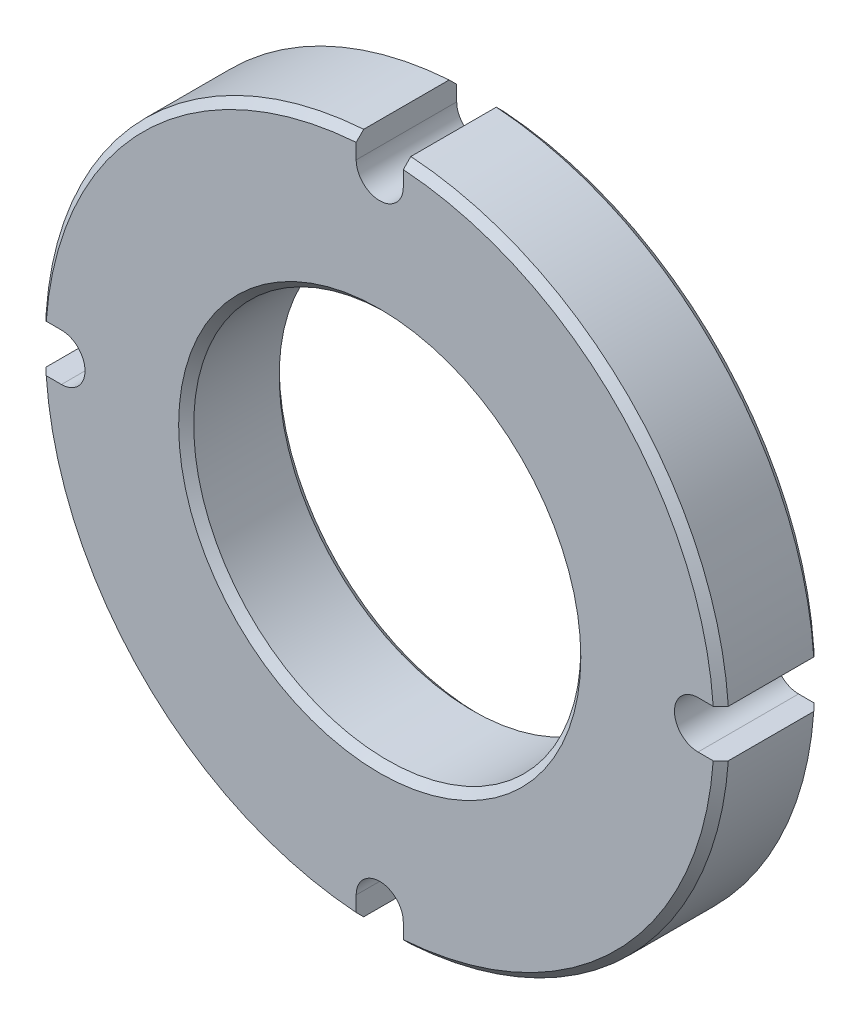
from build123d import *

# Parameters (mm, degrees)
SKETCH1_R          = 17.272
SKETCH1_R_2        = 9.779
EXTRUDE1_DEPTH     = 2.54
CHAMFER1_SIZE      = 0.381
CUT_EXTRUDE1_DEPTH = 25.948955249
CIRPATTERN1_COUNT  = 4


with BuildPart() as part:
    # Sketch1 → Extrude1 (new, symmetric)
    with BuildSketch(Plane.XY):
        Circle(SKETCH1_R)
        Circle(SKETCH1_R_2, mode=Mode.SUBTRACT)
    extrude(amount=EXTRUDE1_DEPTH, both=True)

    # Chamfer1
    chamfer1_edges = [part.edges().sort_by_distance(p)[0] for p in [
        (-17.272, 0, -2.54),
        (-17.272, 0, 2.54),
        (-9.779, 0, -2.54),
        (-9.779, 0, 2.54),
    ]]
    chamfer(chamfer1_edges, length=CHAMFER1_SIZE)

    # Sketch2 → Cut-Extrude1 (cut, through all)
    with BuildSketch(Plane.XY.offset(2.54)):
        with BuildLine():
            Line((-1.190625, -17.272), (-1.190625, -16.081375))
            ThreePointArc((-1.190625, -16.081375), (0, -14.89075), (1.190625, -16.081375))
            Line((1.190625, -16.081375), (1.190625, -17.272))
            Line((1.190625, -17.272), (-1.190625, -17.272))
        make_face()
    cut_extrude1 = extrude(amount=-CUT_EXTRUDE1_DEPTH, mode=Mode.SUBTRACT)

    # CirPattern1: Cut-Extrude1 ×4 about axis
    cirpattern1_axis = Axis((0, 0, 0), (0, 0, 1))
    for i in range(1, CIRPATTERN1_COUNT):
        add(cut_extrude1.rotate(cirpattern1_axis, i * 360 / CIRPATTERN1_COUNT), mode=Mode.SUBTRACT)


solid = part.part
